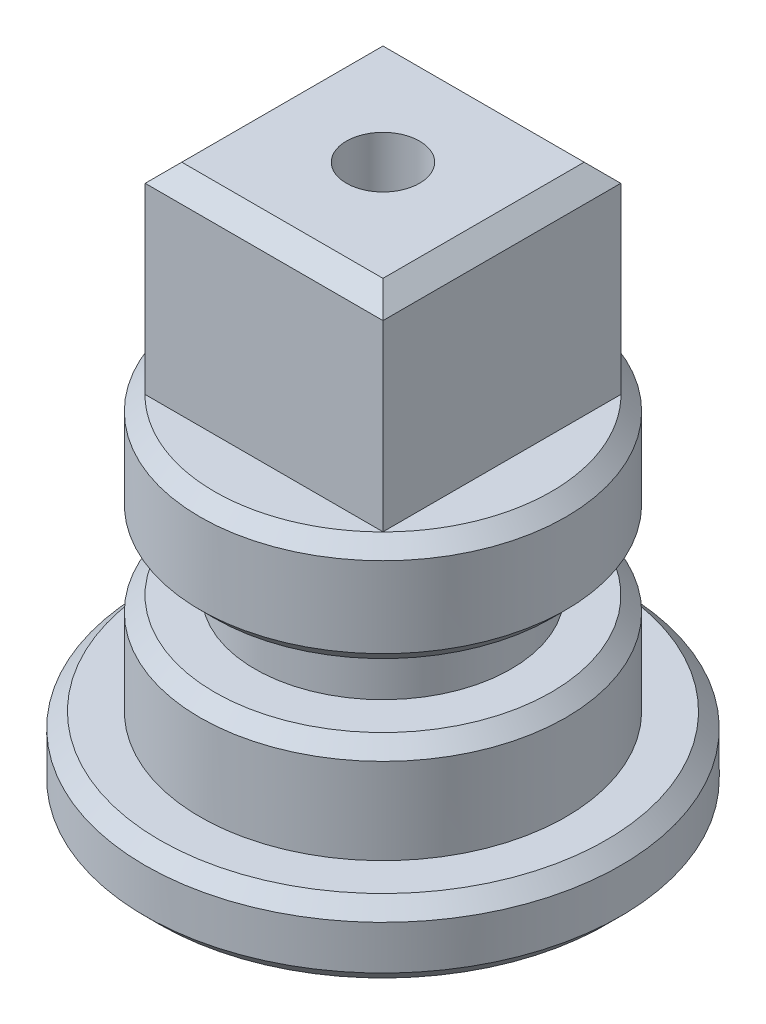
ISO-10303-21;
HEADER;
FILE_DESCRIPTION(('STEP AP214'),'2;1');
FILE_NAME('part.step','',(''),(''),'','','');
FILE_SCHEMA(('AUTOMOTIVE_DESIGN { 1 0 10303 214 1 1 1 1 }'));
ENDSEC;
DATA;
#1=APPLICATION_CONTEXT('core data for automotive mechanical design processes');
#2=APPLICATION_PROTOCOL_DEFINITION('international standard','automotive_design',2000,#1);
#3=PRODUCT_CONTEXT('',#1,'mechanical');
#4=PRODUCT('Part','Part','',(#3));
#5=PRODUCT_RELATED_PRODUCT_CATEGORY('part','',(#4));
#6=PRODUCT_DEFINITION_FORMATION('','',#4);
#7=PRODUCT_DEFINITION_CONTEXT('part definition',#1,'design');
#8=PRODUCT_DEFINITION('design','',#6,#7);
#9=PRODUCT_DEFINITION_SHAPE('','',#8);
#10=(LENGTH_UNIT() NAMED_UNIT(*) SI_UNIT(.MILLI.,.METRE.));
#11=(NAMED_UNIT(*) PLANE_ANGLE_UNIT() SI_UNIT($,.RADIAN.));
#12=(NAMED_UNIT(*) SI_UNIT($,.STERADIAN.) SOLID_ANGLE_UNIT());
#13=UNCERTAINTY_MEASURE_WITH_UNIT(LENGTH_MEASURE(1.E-05),#10,'distance_accuracy_value','');
#14=(GEOMETRIC_REPRESENTATION_CONTEXT(3) GLOBAL_UNCERTAINTY_ASSIGNED_CONTEXT((#13)) GLOBAL_UNIT_ASSIGNED_CONTEXT((#10,
#11,#12)) REPRESENTATION_CONTEXT('',''));
#15=CARTESIAN_POINT('',(0.,0.,0.));
#16=DIRECTION('',(0.,0.,1.));
#17=DIRECTION('',(1.,0.,0.));
#18=AXIS2_PLACEMENT_3D('',#15,#16,#17);
#19=CARTESIAN_POINT('',(-6.5,30.,6.5));
#20=DIRECTION('',(0.,-1.,0.));
#21=DIRECTION('',(0.,0.,-1.));
#22=AXIS2_PLACEMENT_3D('',#19,#20,#21);
#23=PLANE('',#22);
#24=DIRECTION('',(0.,0.,-1.));
#25=VECTOR('',#24,1.);
#26=CARTESIAN_POINT('',(5.49999999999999,30.,6.50000000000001));
#27=LINE('',#26,#25);
#28=CARTESIAN_POINT('',(5.49999999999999,30.,5.49999999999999));
#29=VERTEX_POINT('',#28);
#30=CARTESIAN_POINT('',(5.49999999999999,30.,-5.49999999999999));
#31=VERTEX_POINT('',#30);
#32=EDGE_CURVE('E269',#29,#31,#27,.T.);
#33=ORIENTED_EDGE('',*,*,#32,.T.);
#34=DIRECTION('',(-1.,0.,0.));
#35=VECTOR('',#34,1.);
#36=CARTESIAN_POINT('',(-6.50000000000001,30.,-5.49999999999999));
#37=LINE('',#36,#35);
#38=CARTESIAN_POINT('',(-5.49999999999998,30.,-5.49999999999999));
#39=VERTEX_POINT('',#38);
#40=EDGE_CURVE('E271',#31,#39,#37,.T.);
#41=ORIENTED_EDGE('',*,*,#40,.T.);
#42=DIRECTION('',(0.,0.,1.));
#43=VECTOR('',#42,1.);
#44=CARTESIAN_POINT('',(-5.49999999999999,30.,6.5));
#45=LINE('',#44,#43);
#46=CARTESIAN_POINT('',(-5.49999999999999,30.,5.49999999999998));
#47=VERTEX_POINT('',#46);
#48=EDGE_CURVE('E265',#39,#47,#45,.T.);
#49=ORIENTED_EDGE('',*,*,#48,.T.);
#50=DIRECTION('',(1.,0.,0.));
#51=VECTOR('',#50,1.);
#52=CARTESIAN_POINT('',(6.50000000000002,30.,5.49999999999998));
#53=LINE('',#52,#51);
#54=EDGE_CURVE('E267',#47,#29,#53,.T.);
#55=ORIENTED_EDGE('',*,*,#54,.T.);
#56=EDGE_LOOP('',(#33,#41,#49,#55));
#57=FACE_BOUND('',#56,.T.);
#58=CARTESIAN_POINT('',(0.,30.,0.));
#59=DIRECTION('',(0.,1.,0.));
#60=DIRECTION('',(0.,0.,1.));
#61=AXIS2_PLACEMENT_3D('',#58,#59,#60);
#62=CIRCLE('',#61,2.);
#63=CARTESIAN_POINT('',(0.,30.,2.));
#64=VERTEX_POINT('',#63);
#65=EDGE_CURVE('E289',#64,#64,#62,.T.);
#66=ORIENTED_EDGE('',*,*,#65,.F.);
#67=EDGE_LOOP('',(#66));
#68=FACE_BOUND('',#67,.T.);
#69=ADVANCED_FACE('F34',(#57,#68),#23,.F.);
#70=CARTESIAN_POINT('',(-10.,19.,0.));
#71=DIRECTION('',(0.,1.,0.));
#72=DIRECTION('',(0.,0.,1.));
#73=AXIS2_PLACEMENT_3D('',#70,#71,#72);
#74=PLANE('',#73);
#75=CARTESIAN_POINT('',(0.,19.,0.));
#76=DIRECTION('',(0.,1.,0.));
#77=DIRECTION('',(0.,0.,1.));
#78=AXIS2_PLACEMENT_3D('',#75,#76,#77);
#79=CIRCLE('',#78,9.19999999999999);
#80=CARTESIAN_POINT('',(0.,19.,9.2));
#81=VERTEX_POINT('',#80);
#82=EDGE_CURVE('E259',#81,#81,#79,.T.);
#83=ORIENTED_EDGE('',*,*,#82,.T.);
#84=EDGE_LOOP('',(#83));
#85=FACE_BOUND('',#84,.T.);
#86=DIRECTION('',(-1.,0.,0.));
#87=VECTOR('',#86,1.);
#88=CARTESIAN_POINT('',(6.50000000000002,19.,6.50000000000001));
#89=LINE('',#88,#87);
#90=CARTESIAN_POINT('',(6.50000000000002,19.,6.50000000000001));
#91=VERTEX_POINT('',#90);
#92=CARTESIAN_POINT('',(-6.5,19.,6.5));
#93=VERTEX_POINT('',#92);
#94=EDGE_CURVE('E300',#91,#93,#89,.T.);
#95=ORIENTED_EDGE('',*,*,#94,.T.);
#96=DIRECTION('',(0.,0.,1.));
#97=VECTOR('',#96,1.);
#98=CARTESIAN_POINT('',(-6.50000000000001,19.,-6.50000000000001));
#99=LINE('',#98,#97);
#100=CARTESIAN_POINT('',(-6.50000000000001,19.,-6.50000000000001));
#101=VERTEX_POINT('',#100);
#102=EDGE_CURVE('E297',#101,#93,#99,.T.);
#103=ORIENTED_EDGE('',*,*,#102,.F.);
#104=DIRECTION('',(1.,0.,0.));
#105=VECTOR('',#104,1.);
#106=CARTESIAN_POINT('',(-6.50000000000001,19.,-6.50000000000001));
#107=LINE('',#106,#105);
#108=CARTESIAN_POINT('',(6.5,19.,-6.50000000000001));
#109=VERTEX_POINT('',#108);
#110=EDGE_CURVE('E306',#101,#109,#107,.T.);
#111=ORIENTED_EDGE('',*,*,#110,.T.);
#112=DIRECTION('',(0.,0.,-1.));
#113=VECTOR('',#112,1.);
#114=CARTESIAN_POINT('',(6.50000000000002,19.,6.50000000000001));
#115=LINE('',#114,#113);
#116=EDGE_CURVE('E303',#91,#109,#115,.T.);
#117=ORIENTED_EDGE('',*,*,#116,.F.);
#118=EDGE_LOOP('',(#95,#103,#111,#117));
#119=FACE_BOUND('',#118,.T.);
#120=ADVANCED_FACE('F128',(#85,#119),#74,.T.);
#121=CARTESIAN_POINT('',(0.,0.,0.));
#122=DIRECTION('',(0.,-1.,0.));
#123=DIRECTION('',(0.,0.,-1.));
#124=AXIS2_PLACEMENT_3D('',#121,#122,#123);
#125=PLANE('',#124);
#126=CARTESIAN_POINT('',(0.,0.,0.));
#127=DIRECTION('',(0.,-1.,0.));
#128=DIRECTION('',(0.,0.,-1.));
#129=AXIS2_PLACEMENT_3D('',#126,#127,#128);
#130=CIRCLE('',#129,12.2);
#131=CARTESIAN_POINT('',(0.,0.,-12.2));
#132=VERTEX_POINT('',#131);
#133=EDGE_CURVE('E233',#132,#132,#130,.T.);
#134=ORIENTED_EDGE('',*,*,#133,.T.);
#135=EDGE_LOOP('',(#134));
#136=FACE_BOUND('',#135,.T.);
#137=DIRECTION('',(-1.,0.,0.));
#138=VECTOR('',#137,1.);
#139=CARTESIAN_POINT('',(3.5,0.,-3.5));
#140=LINE('',#139,#138);
#141=CARTESIAN_POINT('',(3.5,0.,-3.5));
#142=VERTEX_POINT('',#141);
#143=CARTESIAN_POINT('',(-3.5,0.,-3.5));
#144=VERTEX_POINT('',#143);
#145=EDGE_CURVE('E320',#142,#144,#140,.T.);
#146=ORIENTED_EDGE('',*,*,#145,.T.);
#147=DIRECTION('',(0.,0.,-1.));
#148=VECTOR('',#147,1.);
#149=CARTESIAN_POINT('',(-3.5,0.,3.5));
#150=LINE('',#149,#148);
#151=CARTESIAN_POINT('',(-3.5,0.,3.5));
#152=VERTEX_POINT('',#151);
#153=EDGE_CURVE('E317',#152,#144,#150,.T.);
#154=ORIENTED_EDGE('',*,*,#153,.F.);
#155=DIRECTION('',(1.,0.,0.));
#156=VECTOR('',#155,1.);
#157=CARTESIAN_POINT('',(-3.5,0.,3.5));
#158=LINE('',#157,#156);
#159=CARTESIAN_POINT('',(3.5,0.,3.5));
#160=VERTEX_POINT('',#159);
#161=EDGE_CURVE('E325',#152,#160,#158,.T.);
#162=ORIENTED_EDGE('',*,*,#161,.T.);
#163=DIRECTION('',(0.,0.,1.));
#164=VECTOR('',#163,1.);
#165=CARTESIAN_POINT('',(3.5,0.,-3.5));
#166=LINE('',#165,#164);
#167=EDGE_CURVE('E322',#142,#160,#166,.T.);
#168=ORIENTED_EDGE('',*,*,#167,.F.);
#169=EDGE_LOOP('',(#146,#154,#162,#168));
#170=FACE_BOUND('',#169,.T.);
#171=ADVANCED_FACE('F36',(#136,#170),#125,.T.);
#172=CARTESIAN_POINT('',(0.,0.,0.));
#173=DIRECTION('',(0.,-1.,0.));
#174=DIRECTION('',(0.,0.,-1.));
#175=AXIS2_PLACEMENT_3D('',#172,#173,#174);
#176=CYLINDRICAL_SURFACE('',#175,13.);
#177=CARTESIAN_POINT('',(0.,0.800000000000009,0.));
#178=DIRECTION('',(0.,-1.,0.));
#179=DIRECTION('',(0.,0.,-1.));
#180=AXIS2_PLACEMENT_3D('',#177,#178,#179);
#181=CIRCLE('',#180,13.);
#182=CARTESIAN_POINT('',(0.,0.800000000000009,-13.));
#183=VERTEX_POINT('',#182);
#184=EDGE_CURVE('E228',#183,#183,#181,.F.);
#185=ORIENTED_EDGE('',*,*,#184,.T.);
#186=EDGE_LOOP('',(#185));
#187=FACE_BOUND('',#186,.T.);
#188=CARTESIAN_POINT('',(0.,3.19999999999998,0.));
#189=DIRECTION('',(0.,1.,0.));
#190=DIRECTION('',(0.,0.,1.));
#191=AXIS2_PLACEMENT_3D('',#188,#189,#190);
#192=CIRCLE('',#191,13.);
#193=CARTESIAN_POINT('',(0.,3.19999999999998,13.));
#194=VERTEX_POINT('',#193);
#195=EDGE_CURVE('E231',#194,#194,#192,.F.);
#196=ORIENTED_EDGE('',*,*,#195,.T.);
#197=EDGE_LOOP('',(#196));
#198=FACE_BOUND('',#197,.T.);
#199=ADVANCED_FACE('F217',(#187,#198),#176,.T.);
#200=CARTESIAN_POINT('',(-13.,4.,0.));
#201=DIRECTION('',(0.,1.,0.));
#202=DIRECTION('',(0.,0.,1.));
#203=AXIS2_PLACEMENT_3D('',#200,#201,#202);
#204=PLANE('',#203);
#205=CARTESIAN_POINT('',(0.,4.,0.));
#206=DIRECTION('',(0.,1.,0.));
#207=DIRECTION('',(0.,0.,1.));
#208=AXIS2_PLACEMENT_3D('',#205,#206,#207);
#209=CIRCLE('',#208,12.2);
#210=CARTESIAN_POINT('',(0.,4.,12.2));
#211=VERTEX_POINT('',#210);
#212=EDGE_CURVE('E235',#211,#211,#209,.T.);
#213=ORIENTED_EDGE('',*,*,#212,.T.);
#214=EDGE_LOOP('',(#213));
#215=FACE_BOUND('',#214,.T.);
#216=CARTESIAN_POINT('',(0.,4.,0.));
#217=DIRECTION('',(0.,-1.,0.));
#218=DIRECTION('',(0.,0.,-1.));
#219=AXIS2_PLACEMENT_3D('',#216,#217,#218);
#220=CIRCLE('',#219,10.);
#221=CARTESIAN_POINT('',(0.,4.,-10.));
#222=VERTEX_POINT('',#221);
#223=EDGE_CURVE('E238',#222,#222,#220,.T.);
#224=ORIENTED_EDGE('',*,*,#223,.T.);
#225=EDGE_LOOP('',(#224));
#226=FACE_BOUND('',#225,.T.);
#227=ADVANCED_FACE('F214',(#215,#226),#204,.T.);
#228=CARTESIAN_POINT('',(0.,0.,0.));
#229=DIRECTION('',(0.,-1.,0.));
#230=DIRECTION('',(0.,0.,-1.));
#231=AXIS2_PLACEMENT_3D('',#228,#229,#230);
#232=CYLINDRICAL_SURFACE('',#231,10.);
#233=CARTESIAN_POINT('',(0.,8.69999999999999,0.));
#234=DIRECTION('',(0.,1.,0.));
#235=DIRECTION('',(0.,0.,1.));
#236=AXIS2_PLACEMENT_3D('',#233,#234,#235);
#237=CIRCLE('',#236,10.);
#238=CARTESIAN_POINT('',(0.,8.69999999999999,10.));
#239=VERTEX_POINT('',#238);
#240=EDGE_CURVE('E244',#239,#239,#237,.F.);
#241=ORIENTED_EDGE('',*,*,#240,.T.);
#242=EDGE_LOOP('',(#241));
#243=FACE_BOUND('',#242,.T.);
#244=ORIENTED_EDGE('',*,*,#223,.F.);
#245=EDGE_LOOP('',(#244));
#246=FACE_BOUND('',#245,.T.);
#247=ADVANCED_FACE('F210',(#243,#246),#232,.T.);
#248=CARTESIAN_POINT('',(-10.,9.5,0.));
#249=DIRECTION('',(0.,1.,0.));
#250=DIRECTION('',(0.,0.,1.));
#251=AXIS2_PLACEMENT_3D('',#248,#249,#250);
#252=PLANE('',#251);
#253=CARTESIAN_POINT('',(0.,9.5,0.));
#254=DIRECTION('',(0.,1.,0.));
#255=DIRECTION('',(0.,0.,1.));
#256=AXIS2_PLACEMENT_3D('',#253,#254,#255);
#257=CIRCLE('',#256,9.19999999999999);
#258=CARTESIAN_POINT('',(0.,9.5,9.2));
#259=VERTEX_POINT('',#258);
#260=EDGE_CURVE('E247',#259,#259,#257,.T.);
#261=ORIENTED_EDGE('',*,*,#260,.T.);
#262=EDGE_LOOP('',(#261));
#263=FACE_BOUND('',#262,.T.);
#264=CARTESIAN_POINT('',(0.,9.5,0.));
#265=DIRECTION('',(0.,-1.,0.));
#266=DIRECTION('',(0.,0.,-1.));
#267=AXIS2_PLACEMENT_3D('',#264,#265,#266);
#268=CIRCLE('',#267,7.);
#269=CARTESIAN_POINT('',(0.,9.5,-7.00000000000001));
#270=VERTEX_POINT('',#269);
#271=EDGE_CURVE('E352',#270,#270,#268,.T.);
#272=ORIENTED_EDGE('',*,*,#271,.T.);
#273=EDGE_LOOP('',(#272));
#274=FACE_BOUND('',#273,.T.);
#275=ADVANCED_FACE('F206',(#263,#274),#252,.T.);
#276=CARTESIAN_POINT('',(0.,0.,0.));
#277=DIRECTION('',(0.,-1.,0.));
#278=DIRECTION('',(0.,0.,-1.));
#279=AXIS2_PLACEMENT_3D('',#276,#277,#278);
#280=CYLINDRICAL_SURFACE('',#279,7.);
#281=CARTESIAN_POINT('',(0.,13.,0.));
#282=DIRECTION('',(0.,-1.,0.));
#283=DIRECTION('',(0.,0.,-1.));
#284=AXIS2_PLACEMENT_3D('',#281,#282,#283);
#285=CIRCLE('',#284,7.);
#286=CARTESIAN_POINT('',(0.,13.,-7.00000000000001));
#287=VERTEX_POINT('',#286);
#288=EDGE_CURVE('E349',#287,#287,#285,.T.);
#289=ORIENTED_EDGE('',*,*,#288,.T.);
#290=EDGE_LOOP('',(#289));
#291=FACE_BOUND('',#290,.T.);
#292=ORIENTED_EDGE('',*,*,#271,.F.);
#293=EDGE_LOOP('',(#292));
#294=FACE_BOUND('',#293,.T.);
#295=ADVANCED_FACE('F202',(#291,#294),#280,.T.);
#296=CARTESIAN_POINT('',(-7.00000000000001,13.,0.));
#297=DIRECTION('',(0.,-1.,0.));
#298=DIRECTION('',(0.,0.,-1.));
#299=AXIS2_PLACEMENT_3D('',#296,#297,#298);
#300=PLANE('',#299);
#301=CARTESIAN_POINT('',(0.,13.,0.));
#302=DIRECTION('',(0.,-1.,0.));
#303=DIRECTION('',(0.,0.,-1.));
#304=AXIS2_PLACEMENT_3D('',#301,#302,#303);
#305=CIRCLE('',#304,9.19999999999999);
#306=CARTESIAN_POINT('',(0.,13.,-9.2));
#307=VERTEX_POINT('',#306);
#308=EDGE_CURVE('E250',#307,#307,#305,.T.);
#309=ORIENTED_EDGE('',*,*,#308,.T.);
#310=EDGE_LOOP('',(#309));
#311=FACE_BOUND('',#310,.T.);
#312=ORIENTED_EDGE('',*,*,#288,.F.);
#313=EDGE_LOOP('',(#312));
#314=FACE_BOUND('',#313,.T.);
#315=ADVANCED_FACE('F198',(#311,#314),#300,.T.);
#316=CARTESIAN_POINT('',(0.,0.,0.));
#317=DIRECTION('',(0.,-1.,0.));
#318=DIRECTION('',(0.,0.,-1.));
#319=AXIS2_PLACEMENT_3D('',#316,#317,#318);
#320=CYLINDRICAL_SURFACE('',#319,10.);
#321=CARTESIAN_POINT('',(0.,13.8,0.));
#322=DIRECTION('',(0.,-1.,0.));
#323=DIRECTION('',(0.,0.,-1.));
#324=AXIS2_PLACEMENT_3D('',#321,#322,#323);
#325=CIRCLE('',#324,10.);
#326=CARTESIAN_POINT('',(0.,13.8,-10.));
#327=VERTEX_POINT('',#326);
#328=EDGE_CURVE('E256',#327,#327,#325,.F.);
#329=ORIENTED_EDGE('',*,*,#328,.T.);
#330=EDGE_LOOP('',(#329));
#331=FACE_BOUND('',#330,.T.);
#332=CARTESIAN_POINT('',(0.,18.2,0.));
#333=DIRECTION('',(0.,1.,0.));
#334=DIRECTION('',(0.,0.,1.));
#335=AXIS2_PLACEMENT_3D('',#332,#333,#334);
#336=CIRCLE('',#335,10.);
#337=CARTESIAN_POINT('',(0.,18.2,10.));
#338=VERTEX_POINT('',#337);
#339=EDGE_CURVE('E253',#338,#338,#336,.F.);
#340=ORIENTED_EDGE('',*,*,#339,.T.);
#341=EDGE_LOOP('',(#340));
#342=FACE_BOUND('',#341,.T.);
#343=ADVANCED_FACE('F193',(#331,#342),#320,.T.);
#344=CARTESIAN_POINT('',(0.,0.,0.));
#345=DIRECTION('',(0.,1.,0.));
#346=DIRECTION('',(0.,0.,1.));
#347=AXIS2_PLACEMENT_3D('',#344,#345,#346);
#348=CONICAL_SURFACE('',#347,12.2,0.785398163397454);
#349=ORIENTED_EDGE('',*,*,#184,.F.);
#350=EDGE_LOOP('',(#349));
#351=FACE_BOUND('',#350,.T.);
#352=ORIENTED_EDGE('',*,*,#133,.F.);
#353=EDGE_LOOP('',(#352));
#354=FACE_BOUND('',#353,.T.);
#355=ADVANCED_FACE('F190',(#351,#354),#348,.T.);
#356=CARTESIAN_POINT('',(0.,3.19999999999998,0.));
#357=DIRECTION('',(0.,-1.,0.));
#358=DIRECTION('',(0.,0.,-1.));
#359=AXIS2_PLACEMENT_3D('',#356,#357,#358);
#360=CONICAL_SURFACE('',#359,13.,0.785398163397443);
#361=ORIENTED_EDGE('',*,*,#212,.F.);
#362=EDGE_LOOP('',(#361));
#363=FACE_BOUND('',#362,.T.);
#364=ORIENTED_EDGE('',*,*,#195,.F.);
#365=EDGE_LOOP('',(#364));
#366=FACE_BOUND('',#365,.T.);
#367=ADVANCED_FACE('F186',(#363,#366),#360,.T.);
#368=CARTESIAN_POINT('',(0.,8.69999999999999,0.));
#369=DIRECTION('',(0.,-1.,0.));
#370=DIRECTION('',(0.,0.,-1.));
#371=AXIS2_PLACEMENT_3D('',#368,#369,#370);
#372=CONICAL_SURFACE('',#371,10.,0.785398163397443);
#373=ORIENTED_EDGE('',*,*,#260,.F.);
#374=EDGE_LOOP('',(#373));
#375=FACE_BOUND('',#374,.T.);
#376=ORIENTED_EDGE('',*,*,#240,.F.);
#377=EDGE_LOOP('',(#376));
#378=FACE_BOUND('',#377,.T.);
#379=ADVANCED_FACE('F182',(#375,#378),#372,.T.);
#380=CARTESIAN_POINT('',(0.,13.,0.));
#381=DIRECTION('',(0.,1.,0.));
#382=DIRECTION('',(0.,0.,1.));
#383=AXIS2_PLACEMENT_3D('',#380,#381,#382);
#384=CONICAL_SURFACE('',#383,9.19999999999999,0.785398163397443);
#385=ORIENTED_EDGE('',*,*,#328,.F.);
#386=EDGE_LOOP('',(#385));
#387=FACE_BOUND('',#386,.T.);
#388=ORIENTED_EDGE('',*,*,#308,.F.);
#389=EDGE_LOOP('',(#388));
#390=FACE_BOUND('',#389,.T.);
#391=ADVANCED_FACE('F178',(#387,#390),#384,.T.);
#392=CARTESIAN_POINT('',(0.,18.2,0.));
#393=DIRECTION('',(0.,-1.,0.));
#394=DIRECTION('',(0.,0.,-1.));
#395=AXIS2_PLACEMENT_3D('',#392,#393,#394);
#396=CONICAL_SURFACE('',#395,10.,0.785398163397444);
#397=ORIENTED_EDGE('',*,*,#82,.F.);
#398=EDGE_LOOP('',(#397));
#399=FACE_BOUND('',#398,.T.);
#400=ORIENTED_EDGE('',*,*,#339,.F.);
#401=EDGE_LOOP('',(#400));
#402=FACE_BOUND('',#401,.T.);
#403=ADVANCED_FACE('F174',(#399,#402),#396,.T.);
#404=CARTESIAN_POINT('',(-3.5,-4.00000000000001,3.5));
#405=DIRECTION('',(1.,0.,0.));
#406=DIRECTION('',(0.,0.,-1.));
#407=AXIS2_PLACEMENT_3D('',#404,#405,#406);
#408=PLANE('',#407);
#409=ORIENTED_EDGE('',*,*,#153,.T.);
#410=DIRECTION('',(0.,1.,0.));
#411=VECTOR('',#410,1.);
#412=CARTESIAN_POINT('',(-3.5,-4.,-3.5));
#413=LINE('',#412,#411);
#414=CARTESIAN_POINT('',(-3.5,-4.,-3.5));
#415=VERTEX_POINT('',#414);
#416=EDGE_CURVE('E346',#415,#144,#413,.T.);
#417=ORIENTED_EDGE('',*,*,#416,.F.);
#418=DIRECTION('',(0.,0.,-1.));
#419=VECTOR('',#418,1.);
#420=CARTESIAN_POINT('',(-3.5,-4.00000000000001,3.5));
#421=LINE('',#420,#419);
#422=CARTESIAN_POINT('',(-3.5,-4.00000000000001,3.5));
#423=VERTEX_POINT('',#422);
#424=EDGE_CURVE('E327',#423,#415,#421,.T.);
#425=ORIENTED_EDGE('',*,*,#424,.F.);
#426=DIRECTION('',(0.,1.,0.));
#427=VECTOR('',#426,1.);
#428=CARTESIAN_POINT('',(-3.5,-4.00000000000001,3.5));
#429=LINE('',#428,#427);
#430=EDGE_CURVE('E337',#423,#152,#429,.T.);
#431=ORIENTED_EDGE('',*,*,#430,.T.);
#432=EDGE_LOOP('',(#409,#417,#425,#431));
#433=FACE_BOUND('',#432,.T.);
#434=ADVANCED_FACE('F170',(#433),#408,.F.);
#435=CARTESIAN_POINT('',(3.5,-3.99999999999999,-3.5));
#436=DIRECTION('',(0.,0.,-1.));
#437=DIRECTION('',(-1.,0.,0.));
#438=AXIS2_PLACEMENT_3D('',#435,#436,#437);
#439=PLANE('',#438);
#440=ORIENTED_EDGE('',*,*,#145,.F.);
#441=DIRECTION('',(0.,1.,0.));
#442=VECTOR('',#441,1.);
#443=CARTESIAN_POINT('',(3.5,-3.99999999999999,-3.5));
#444=LINE('',#443,#442);
#445=CARTESIAN_POINT('',(3.5,-3.99999999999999,-3.5));
#446=VERTEX_POINT('',#445);
#447=EDGE_CURVE('E343',#446,#142,#444,.T.);
#448=ORIENTED_EDGE('',*,*,#447,.F.);
#449=DIRECTION('',(-1.,0.,0.));
#450=VECTOR('',#449,1.);
#451=CARTESIAN_POINT('',(3.5,-3.99999999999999,-3.5));
#452=LINE('',#451,#450);
#453=EDGE_CURVE('E329',#446,#415,#452,.T.);
#454=ORIENTED_EDGE('',*,*,#453,.T.);
#455=ORIENTED_EDGE('',*,*,#416,.T.);
#456=EDGE_LOOP('',(#440,#448,#454,#455));
#457=FACE_BOUND('',#456,.T.);
#458=ADVANCED_FACE('F166',(#457),#439,.T.);
#459=CARTESIAN_POINT('',(3.5,-3.99999999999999,-3.5));
#460=DIRECTION('',(-1.,0.,0.));
#461=DIRECTION('',(0.,0.,1.));
#462=AXIS2_PLACEMENT_3D('',#459,#460,#461);
#463=PLANE('',#462);
#464=ORIENTED_EDGE('',*,*,#167,.T.);
#465=DIRECTION('',(0.,1.,0.));
#466=VECTOR('',#465,1.);
#467=CARTESIAN_POINT('',(3.5,-4.,3.5));
#468=LINE('',#467,#466);
#469=CARTESIAN_POINT('',(3.5,-4.,3.5));
#470=VERTEX_POINT('',#469);
#471=EDGE_CURVE('E340',#470,#160,#468,.T.);
#472=ORIENTED_EDGE('',*,*,#471,.F.);
#473=DIRECTION('',(0.,0.,1.));
#474=VECTOR('',#473,1.);
#475=CARTESIAN_POINT('',(3.5,-3.99999999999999,-3.5));
#476=LINE('',#475,#474);
#477=EDGE_CURVE('E332',#446,#470,#476,.T.);
#478=ORIENTED_EDGE('',*,*,#477,.F.);
#479=ORIENTED_EDGE('',*,*,#447,.T.);
#480=EDGE_LOOP('',(#464,#472,#478,#479));
#481=FACE_BOUND('',#480,.T.);
#482=ADVANCED_FACE('F162',(#481),#463,.F.);
#483=CARTESIAN_POINT('',(-3.5,-4.00000000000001,3.5));
#484=DIRECTION('',(0.,0.,1.));
#485=DIRECTION('',(1.,0.,0.));
#486=AXIS2_PLACEMENT_3D('',#483,#484,#485);
#487=PLANE('',#486);
#488=ORIENTED_EDGE('',*,*,#161,.F.);
#489=ORIENTED_EDGE('',*,*,#430,.F.);
#490=DIRECTION('',(1.,0.,0.));
#491=VECTOR('',#490,1.);
#492=CARTESIAN_POINT('',(-3.5,-4.00000000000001,3.5));
#493=LINE('',#492,#491);
#494=EDGE_CURVE('E334',#423,#470,#493,.T.);
#495=ORIENTED_EDGE('',*,*,#494,.T.);
#496=ORIENTED_EDGE('',*,*,#471,.T.);
#497=EDGE_LOOP('',(#488,#489,#495,#496));
#498=FACE_BOUND('',#497,.T.);
#499=ADVANCED_FACE('F158',(#498),#487,.T.);
#500=CARTESIAN_POINT('',(-3.5,-4.00000000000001,3.5));
#501=DIRECTION('',(0.,-1.,0.));
#502=DIRECTION('',(0.,0.,-1.));
#503=AXIS2_PLACEMENT_3D('',#500,#501,#502);
#504=PLANE('',#503);
#505=ORIENTED_EDGE('',*,*,#424,.T.);
#506=ORIENTED_EDGE('',*,*,#453,.F.);
#507=ORIENTED_EDGE('',*,*,#477,.T.);
#508=ORIENTED_EDGE('',*,*,#494,.F.);
#509=EDGE_LOOP('',(#505,#506,#507,#508));
#510=FACE_BOUND('',#509,.T.);
#511=ADVANCED_FACE('F154',(#510),#504,.T.);
#512=CARTESIAN_POINT('',(-6.5,30.,-6.50000000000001));
#513=DIRECTION('',(1.,0.,0.));
#514=DIRECTION('',(0.,0.,-1.));
#515=AXIS2_PLACEMENT_3D('',#512,#513,#514);
#516=PLANE('',#515);
#517=DIRECTION('',(0.,-1.,0.));
#518=VECTOR('',#517,1.);
#519=CARTESIAN_POINT('',(-6.5,30.,6.5));
#520=LINE('',#519,#518);
#521=CARTESIAN_POINT('',(-6.5,29.,6.5));
#522=VERTEX_POINT('',#521);
#523=EDGE_CURVE('E315',#522,#93,#520,.T.);
#524=ORIENTED_EDGE('',*,*,#523,.F.);
#525=DIRECTION('',(0.,0.,-1.));
#526=VECTOR('',#525,1.);
#527=CARTESIAN_POINT('',(-6.50000000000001,29.,-6.50000000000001));
#528=LINE('',#527,#526);
#529=CARTESIAN_POINT('',(-6.50000000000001,29.,-6.50000000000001));
#530=VERTEX_POINT('',#529);
#531=EDGE_CURVE('E11',#522,#530,#528,.T.);
#532=ORIENTED_EDGE('',*,*,#531,.T.);
#533=DIRECTION('',(0.,-1.,0.));
#534=VECTOR('',#533,1.);
#535=CARTESIAN_POINT('',(-6.5,30.,-6.50000000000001));
#536=LINE('',#535,#534);
#537=EDGE_CURVE('E309',#530,#101,#536,.T.);
#538=ORIENTED_EDGE('',*,*,#537,.T.);
#539=ORIENTED_EDGE('',*,*,#102,.T.);
#540=EDGE_LOOP('',(#524,#532,#538,#539));
#541=FACE_BOUND('',#540,.T.);
#542=ADVANCED_FACE('F151',(#541),#516,.F.);
#543=CARTESIAN_POINT('',(6.5,30.,6.5));
#544=DIRECTION('',(0.,0.,1.));
#545=DIRECTION('',(1.,0.,0.));
#546=AXIS2_PLACEMENT_3D('',#543,#544,#545);
#547=PLANE('',#546);
#548=DIRECTION('',(0.,-1.,0.));
#549=VECTOR('',#548,1.);
#550=CARTESIAN_POINT('',(6.5,30.,6.5));
#551=LINE('',#550,#549);
#552=CARTESIAN_POINT('',(6.50000000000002,29.,6.5));
#553=VERTEX_POINT('',#552);
#554=EDGE_CURVE('E313',#553,#91,#551,.T.);
#555=ORIENTED_EDGE('',*,*,#554,.F.);
#556=DIRECTION('',(-1.,0.,0.));
#557=VECTOR('',#556,1.);
#558=CARTESIAN_POINT('',(-6.5,29.,6.5));
#559=LINE('',#558,#557);
#560=EDGE_CURVE('E42',#553,#522,#559,.T.);
#561=ORIENTED_EDGE('',*,*,#560,.T.);
#562=ORIENTED_EDGE('',*,*,#523,.T.);
#563=ORIENTED_EDGE('',*,*,#94,.F.);
#564=EDGE_LOOP('',(#555,#561,#562,#563));
#565=FACE_BOUND('',#564,.T.);
#566=ADVANCED_FACE('F148',(#565),#547,.T.);
#567=CARTESIAN_POINT('',(6.5,30.,6.5));
#568=DIRECTION('',(-1.,0.,0.));
#569=DIRECTION('',(0.,0.,1.));
#570=AXIS2_PLACEMENT_3D('',#567,#568,#569);
#571=PLANE('',#570);
#572=DIRECTION('',(0.,-1.,0.));
#573=VECTOR('',#572,1.);
#574=CARTESIAN_POINT('',(6.5,30.,-6.50000000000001));
#575=LINE('',#574,#573);
#576=CARTESIAN_POINT('',(6.5,29.,-6.50000000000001));
#577=VERTEX_POINT('',#576);
#578=EDGE_CURVE('E311',#577,#109,#575,.T.);
#579=ORIENTED_EDGE('',*,*,#578,.F.);
#580=DIRECTION('',(0.,0.,1.));
#581=VECTOR('',#580,1.);
#582=CARTESIAN_POINT('',(6.50000000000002,29.,6.5));
#583=LINE('',#582,#581);
#584=EDGE_CURVE('E56',#577,#553,#583,.T.);
#585=ORIENTED_EDGE('',*,*,#584,.T.);
#586=ORIENTED_EDGE('',*,*,#554,.T.);
#587=ORIENTED_EDGE('',*,*,#116,.T.);
#588=EDGE_LOOP('',(#579,#585,#586,#587));
#589=FACE_BOUND('',#588,.T.);
#590=ADVANCED_FACE('F144',(#589),#571,.F.);
#591=CARTESIAN_POINT('',(-6.5,30.,-6.50000000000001));
#592=DIRECTION('',(0.,0.,-1.));
#593=DIRECTION('',(-1.,0.,0.));
#594=AXIS2_PLACEMENT_3D('',#591,#592,#593);
#595=PLANE('',#594);
#596=ORIENTED_EDGE('',*,*,#537,.F.);
#597=DIRECTION('',(1.,0.,0.));
#598=VECTOR('',#597,1.);
#599=CARTESIAN_POINT('',(6.5,29.,-6.50000000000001));
#600=LINE('',#599,#598);
#601=EDGE_CURVE('E262',#530,#577,#600,.T.);
#602=ORIENTED_EDGE('',*,*,#601,.T.);
#603=ORIENTED_EDGE('',*,*,#578,.T.);
#604=ORIENTED_EDGE('',*,*,#110,.F.);
#605=EDGE_LOOP('',(#596,#602,#603,#604));
#606=FACE_BOUND('',#605,.T.);
#607=ADVANCED_FACE('F141',(#606),#595,.T.);
#608=CARTESIAN_POINT('',(6.50000000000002,29.,6.5));
#609=DIRECTION('',(0.,0.707106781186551,0.707106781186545));
#610=DIRECTION('',(0.,-0.707106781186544,0.707106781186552));
#611=AXIS2_PLACEMENT_3D('',#608,#609,#610);
#612=PLANE('',#611);
#613=DIRECTION('',(0.577350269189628,-0.577350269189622,0.577350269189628));
#614=VECTOR('',#613,1.);
#615=CARTESIAN_POINT('',(6.50000000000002,29.,6.5));
#616=LINE('',#615,#614);
#617=EDGE_CURVE('E287',#29,#553,#616,.T.);
#618=ORIENTED_EDGE('',*,*,#617,.F.);
#619=ORIENTED_EDGE('',*,*,#54,.F.);
#620=DIRECTION('',(-0.577350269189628,-0.577350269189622,0.577350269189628));
#621=VECTOR('',#620,1.);
#622=CARTESIAN_POINT('',(-5.83333333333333,29.6666666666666,5.83333333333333));
#623=LINE('',#622,#621);
#624=EDGE_CURVE('E294',#522,#47,#623,.F.);
#625=ORIENTED_EDGE('',*,*,#624,.F.);
#626=ORIENTED_EDGE('',*,*,#560,.F.);
#627=EDGE_LOOP('',(#618,#619,#625,#626));
#628=FACE_BOUND('',#627,.T.);
#629=ADVANCED_FACE('F139',(#628),#612,.T.);
#630=CARTESIAN_POINT('',(-5.49999999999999,30.,6.5));
#631=DIRECTION('',(0.707106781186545,-0.707106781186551,0.));
#632=DIRECTION('',(0.707106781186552,0.707106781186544,0.));
#633=AXIS2_PLACEMENT_3D('',#630,#631,#632);
#634=PLANE('',#633);
#635=ORIENTED_EDGE('',*,*,#624,.T.);
#636=ORIENTED_EDGE('',*,*,#48,.F.);
#637=DIRECTION('',(0.577350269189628,0.577350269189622,0.577350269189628));
#638=VECTOR('',#637,1.);
#639=CARTESIAN_POINT('',(-1.49999999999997,34.,-1.49999999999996));
#640=LINE('',#639,#638);
#641=EDGE_CURVE('E282',#530,#39,#640,.T.);
#642=ORIENTED_EDGE('',*,*,#641,.F.);
#643=ORIENTED_EDGE('',*,*,#531,.F.);
#644=EDGE_LOOP('',(#635,#636,#642,#643));
#645=FACE_BOUND('',#644,.T.);
#646=ADVANCED_FACE('F381',(#645),#634,.F.);
#647=CARTESIAN_POINT('',(5.49999999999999,30.,6.50000000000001));
#648=DIRECTION('',(-0.707106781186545,-0.707106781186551,0.));
#649=DIRECTION('',(0.707106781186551,-0.707106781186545,0.));
#650=AXIS2_PLACEMENT_3D('',#647,#648,#649);
#651=PLANE('',#650);
#652=ORIENTED_EDGE('',*,*,#617,.T.);
#653=ORIENTED_EDGE('',*,*,#584,.F.);
#654=DIRECTION('',(0.577350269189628,-0.577350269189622,-0.577350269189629));
#655=VECTOR('',#654,1.);
#656=CARTESIAN_POINT('',(1.49999999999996,34.,-1.49999999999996));
#657=LINE('',#656,#655);
#658=EDGE_CURVE('E280',#31,#577,#657,.T.);
#659=ORIENTED_EDGE('',*,*,#658,.F.);
#660=ORIENTED_EDGE('',*,*,#32,.F.);
#661=EDGE_LOOP('',(#652,#653,#659,#660));
#662=FACE_BOUND('',#661,.T.);
#663=ADVANCED_FACE('F123',(#662),#651,.F.);
#664=CARTESIAN_POINT('',(-6.50000000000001,29.,-6.50000000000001));
#665=DIRECTION('',(0.,0.707106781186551,-0.707106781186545));
#666=DIRECTION('',(0.,0.707106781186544,0.707106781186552));
#667=AXIS2_PLACEMENT_3D('',#664,#665,#666);
#668=PLANE('',#667);
#669=ORIENTED_EDGE('',*,*,#641,.T.);
#670=ORIENTED_EDGE('',*,*,#40,.F.);
#671=ORIENTED_EDGE('',*,*,#658,.T.);
#672=ORIENTED_EDGE('',*,*,#601,.F.);
#673=EDGE_LOOP('',(#669,#670,#671,#672));
#674=FACE_BOUND('',#673,.T.);
#675=ADVANCED_FACE('F114',(#674),#668,.T.);
#676=CARTESIAN_POINT('',(0.,13.7982787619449,0.));
#677=DIRECTION('',(0.,1.,0.));
#678=DIRECTION('',(0.,0.,1.));
#679=AXIS2_PLACEMENT_3D('',#676,#677,#678);
#680=CONICAL_SURFACE('',#679,0.,1.02974425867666);
#681=CARTESIAN_POINT('',(0.,15.,0.));
#682=DIRECTION('',(0.,1.,0.));
#683=DIRECTION('',(0.,0.,1.));
#684=AXIS2_PLACEMENT_3D('',#681,#682,#683);
#685=CIRCLE('',#684,2.);
#686=CARTESIAN_POINT('',(0.,15.,2.));
#687=VERTEX_POINT('',#686);
#688=EDGE_CURVE('E285',#687,#687,#685,.T.);
#689=ORIENTED_EDGE('',*,*,#688,.T.);
#690=EDGE_LOOP('',(#689));
#691=FACE_BOUND('',#690,.T.);
#692=CARTESIAN_POINT('',(0.,13.7982787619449,0.));
#693=VERTEX_POINT('',#692);
#694=VERTEX_LOOP('',#693);
#695=FACE_BOUND('',#694,.T.);
#696=ADVANCED_FACE('F111',(#691,#695),#680,.F.);
#697=CARTESIAN_POINT('',(0.,30.,0.));
#698=DIRECTION('',(0.,1.,0.));
#699=DIRECTION('',(0.,0.,1.));
#700=AXIS2_PLACEMENT_3D('',#697,#698,#699);
#701=CYLINDRICAL_SURFACE('',#700,2.);
#702=ORIENTED_EDGE('',*,*,#65,.T.);
#703=EDGE_LOOP('',(#702));
#704=FACE_BOUND('',#703,.T.);
#705=ORIENTED_EDGE('',*,*,#688,.F.);
#706=EDGE_LOOP('',(#705));
#707=FACE_BOUND('',#706,.T.);
#708=ADVANCED_FACE('F113',(#704,#707),#701,.F.);
#709=CLOSED_SHELL('',(#69,#120,#171,#199,#227,#247,#275,#295,#315,#343,#355,#367,#379,#391,#403,
#434,#458,#482,#499,#511,#542,#566,#590,#607,#629,#646,#663,#675,#696,#708));
#710=MANIFOLD_SOLID_BREP('B2',#709);
#711=ADVANCED_BREP_SHAPE_REPRESENTATION('',(#18,#710),#14);
#712=SHAPE_DEFINITION_REPRESENTATION(#9,#711);
ENDSEC;
END-ISO-10303-21;
